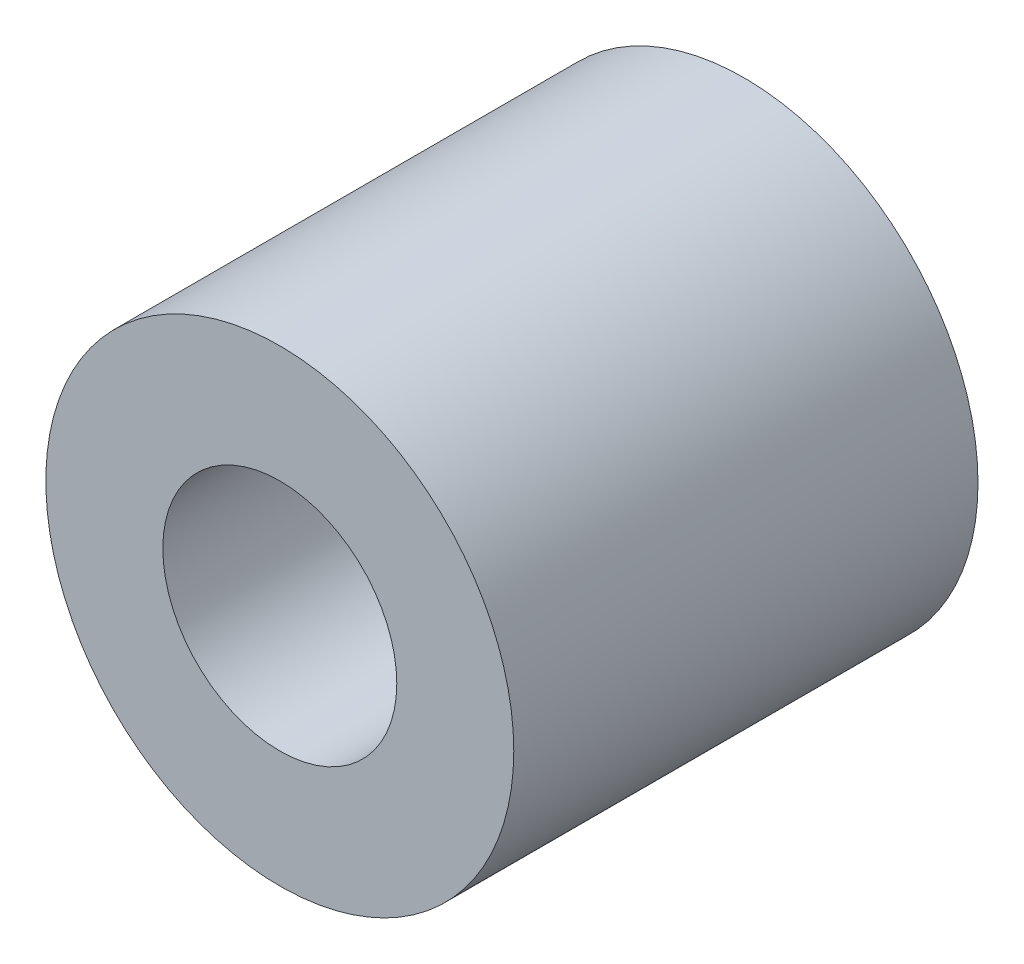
from build123d import *

# Parameters (mm, degrees)
SKETCH1_R      = 3.2004
SKETCH1_R_2    = 1.6002
EXTRUDE1_DEPTH = 3.175


with BuildPart() as part:
    # Sketch1 → Extrude1 (new, symmetric)
    with BuildSketch(Plane.XY):
        Circle(SKETCH1_R)
        Circle(SKETCH1_R_2, mode=Mode.SUBTRACT)
    extrude(amount=EXTRUDE1_DEPTH, both=True)


solid = part.part
